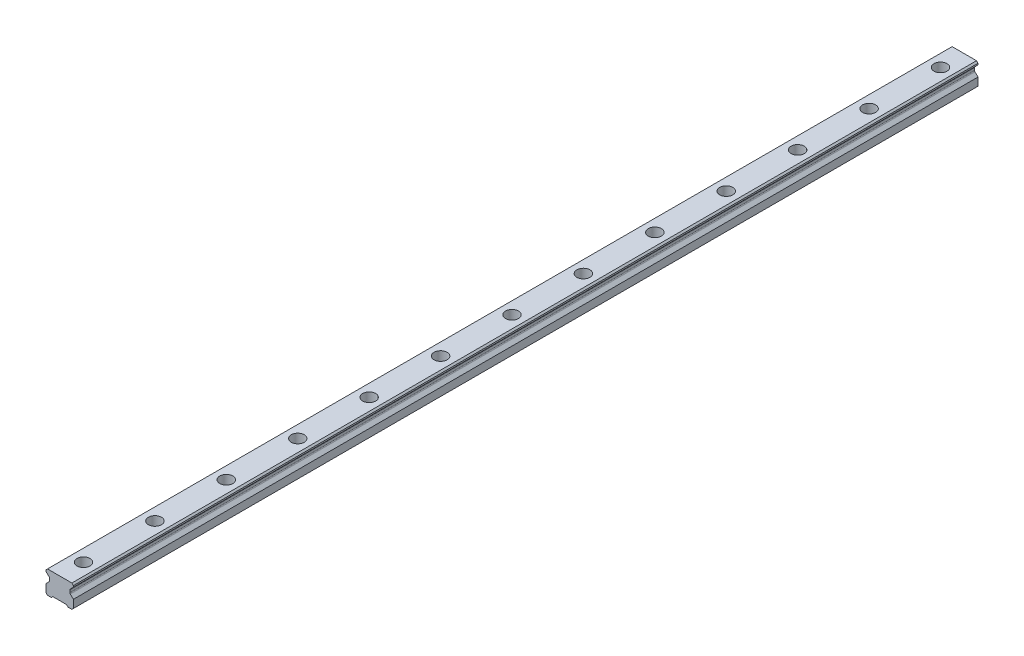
from build123d import *

# Parameters (mm, degrees)
SKETCH1_W           = 23
SKETCH1_H           = 19.2
BOSS_EXTRUDE1_DEPTH = 380
CUT_EXTRUDE1_DEPTH  = 761.329461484
CHAMFER1_SIZE       = 1.25
FILLET1_R           = 1.25
CUT_EXTRUDE2_DEPTH  = 761.329461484
SKETCH4_R           = 5.5
SKETCH4_R_2         = 3.5
CUT_EXTRUDE3_DEPTH  = 9
SKETCH4_2_R         = 3.5
CUT_EXTRUDE4_DEPTH  = 381.658495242
LPATTERN1_COUNT     = 13
LPATTERN1_PITCH     = 60


with BuildPart() as part:
    # Sketch1 → Boss-Extrude1 (new, symmetric)
    with BuildSketch(Plane.XY):
        with Locations((0, 9.6)):
            Rectangle(SKETCH1_W, SKETCH1_H)
    extrude(amount=BOSS_EXTRUDE1_DEPTH, both=True)

    # Sketch2 → Cut-Extrude1 (cut, through all)
    with BuildSketch(Plane.XY.offset(380)):
        Polygon((-11.5, 16.7), (-11.5, 7.95), (-8.583333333, 10.866666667), (-8.583333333, 13.783333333), align=None)
        Polygon((8.583333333, 13.783333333), (11.5, 16.7), (11.5, 7.95), (8.583333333, 10.866666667), align=None)
    extrude(amount=-CUT_EXTRUDE1_DEPTH, mode=Mode.SUBTRACT)

    # Chamfer1
    chamfer1_edges = [part.edges().sort_by_distance(p)[0] for p in [
        (-11.5, 19.2, 0),
        (11.5, 19.2, 0),
        (11.5, 0, 0),
        (-11.5, 0, 0),
    ]]
    chamfer(chamfer1_edges, length=CHAMFER1_SIZE)

    # Fillet1
    fillet1_edges = [part.edges().sort_by_distance(p)[0] for p in [
        (-8.583333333, 13.783333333, 0),
        (-8.583333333, 10.866666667, 0),
        (8.583333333, 10.866666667, 0),
        (8.583333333, 13.783333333, 0),
    ]]
    fillet(fillet1_edges, radius=FILLET1_R)

    # Sketch3 → Cut-Extrude2 (cut, through all)
    with BuildSketch(Plane.XY.offset(380)):
        Polygon((-7, 0), (-5.75, 1.25), (5.75, 1.25), (7, 0), align=None)
    extrude(amount=-CUT_EXTRUDE2_DEPTH, mode=Mode.SUBTRACT)

    # Sketch4 → Cut-Extrude3 (cut)
    with BuildSketch(Plane(origin=(0, 19.2, 0), x_dir=(1, 0, 0), z_dir=(0, 1, 0))):
        with Locations(Location((0, -360, 0), (0, 0, 270))):
            Circle(SKETCH4_R)
        with Locations(Location((0, -360, 0), (0, 0, 270))):
            Circle(SKETCH4_R_2, mode=Mode.SUBTRACT)
    cut_extrude3 = extrude(amount=-CUT_EXTRUDE3_DEPTH, mode=Mode.SUBTRACT)

    # Sketch4_2 → Cut-Extrude4 (cut, through all)
    with BuildSketch(Plane(origin=(0, 19.2, 0), x_dir=(1, 0, 0), z_dir=(0, 1, 0))):
        with Locations(Location((0, -360, 0), (0, 0, 270))):
            Circle(SKETCH4_2_R)
    cut_extrude4 = extrude(amount=-CUT_EXTRUDE4_DEPTH, mode=Mode.SUBTRACT)

    # LPattern1: Cut-Extrude3, Cut-Extrude4 ×13
    with Locations(*[(0, 0, -i * LPATTERN1_PITCH) for i in range(1, LPATTERN1_COUNT)]):
        add(cut_extrude3, mode=Mode.SUBTRACT)
        add(cut_extrude4, mode=Mode.SUBTRACT)


solid = part.part
